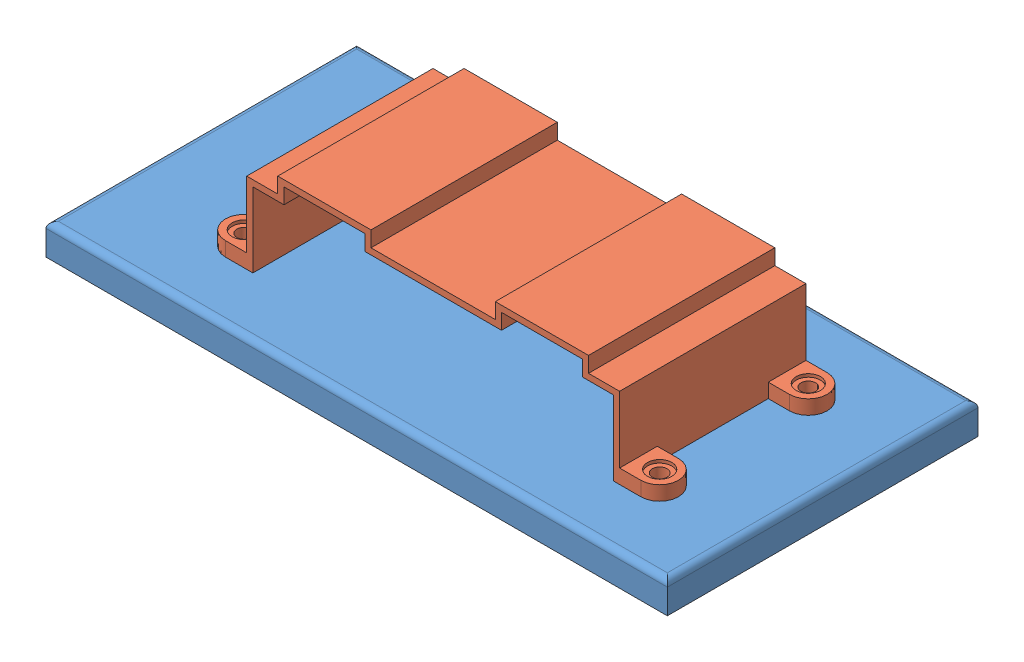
SolidWorks assembly Hole Allignment.SLDASM, configuration Default (file format 3678). Lengths in mm.
Overall size (254 52.07 127).
2 component instances, 2 part files, 2 mates.
Components (placement in the parent):
- base-1: base.SLDPRT [Default] at (103.2786 -58.8328 -14.5286) size (254 12.7 127)
- hold-1: hold.SLDPRT [Default] at (-16.4977 -46.1328 -114.7378) x (1 0 -0.000342) z (0.000342 0 1) size (185.16 39.37 76.2)
Mates (geometry in assembly coordinates):
- Coincident1: coincident anti-aligned: plane of base-1 through (103.2786 -46.1328 -141.5286) normal (0 1 0); plane of hold-1 through (59.7284 -46.1328 -38.5639) normal (0 -1 0)
- Concentric1: concentric aligned: cylinder of base-1; cylinder of ?
